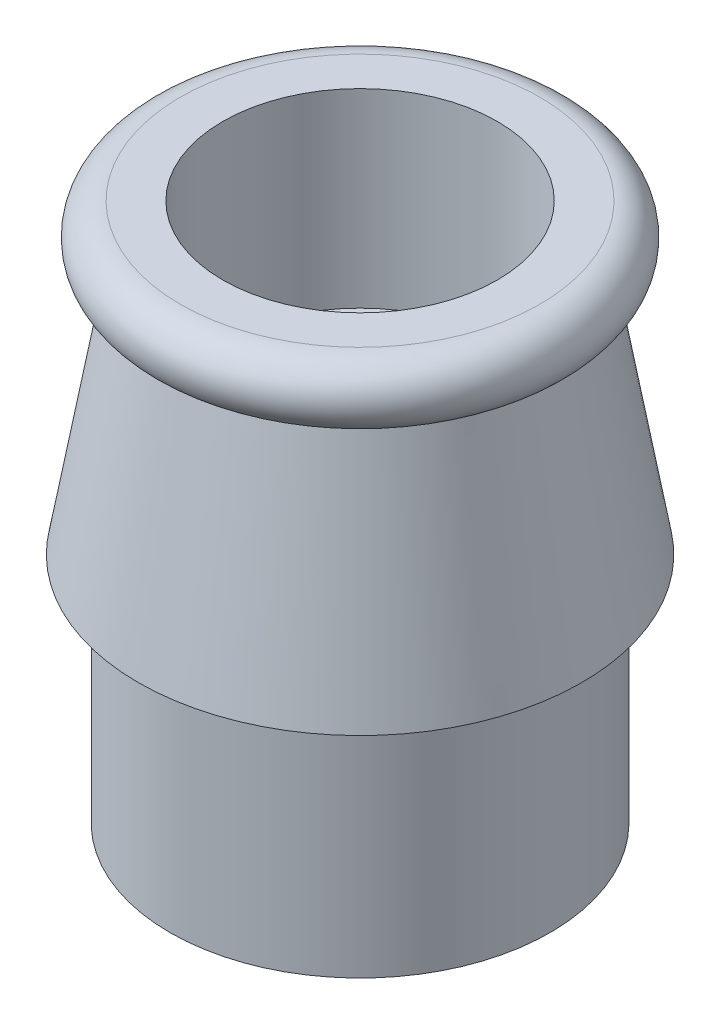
from build123d import *

# Parameters (mm, degrees)
TAGLIO_ESTRUSIONE1_REACH = 31.508


with BuildPart() as part:
    # Schizzo1 → Rivoluzione1 (revolve)
    with BuildSketch(Plane.XY, mode=Mode.PRIVATE) as rivoluzione1_sk:
        with BuildLine():
            Line((6.5, 8.25), (6.5, 17.25))
            Line((6.5, 17.25), (8.5, 17.25))
            ThreePointArc((8.5, 17.25), (10, 15.75), (8.5, 14.25))
            Line((8.5, 14.25), (10.5, 2.75))
            Line((10.5, 2.75), (9, 2.75))
            Line((9, 2.75), (9, -8.25))
            Line((9, -8.25), (0, -8.25))
            Line((0, -8.25), (0, 8.25))
            Line((0, 8.25), (6.5, 8.25))
        make_face()
    revolve(rivoluzione1_sk.sketch.rotate(Axis((0, 90, 0), (0, -1, 0)), 90), axis=Axis((0, 90, 0), (0, -1, 0)))

    # Schizzo2 → Taglio-Estrusione1 (cut, up to next)
    with BuildSketch(Plane.XZ.offset(8.25), mode=Mode.PRIVATE) as taglio_estrusione1_sk1:
        Polygon((-4.330127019, 2.5), (-4.330127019, -2.5), (0, -5), (4.330127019, -2.5), (4.330127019, 2.5), (0, 5), align=None)
    taglio_estrusione1_tool1 = extrude(taglio_estrusione1_sk1.sketch, amount=-TAGLIO_ESTRUSIONE1_REACH, mode=Mode.PRIVATE) & part.part
    add(taglio_estrusione1_tool1.solids().sort_by_distance((0, -8.25, 0))[0], mode=Mode.SUBTRACT)


solid = part.part
